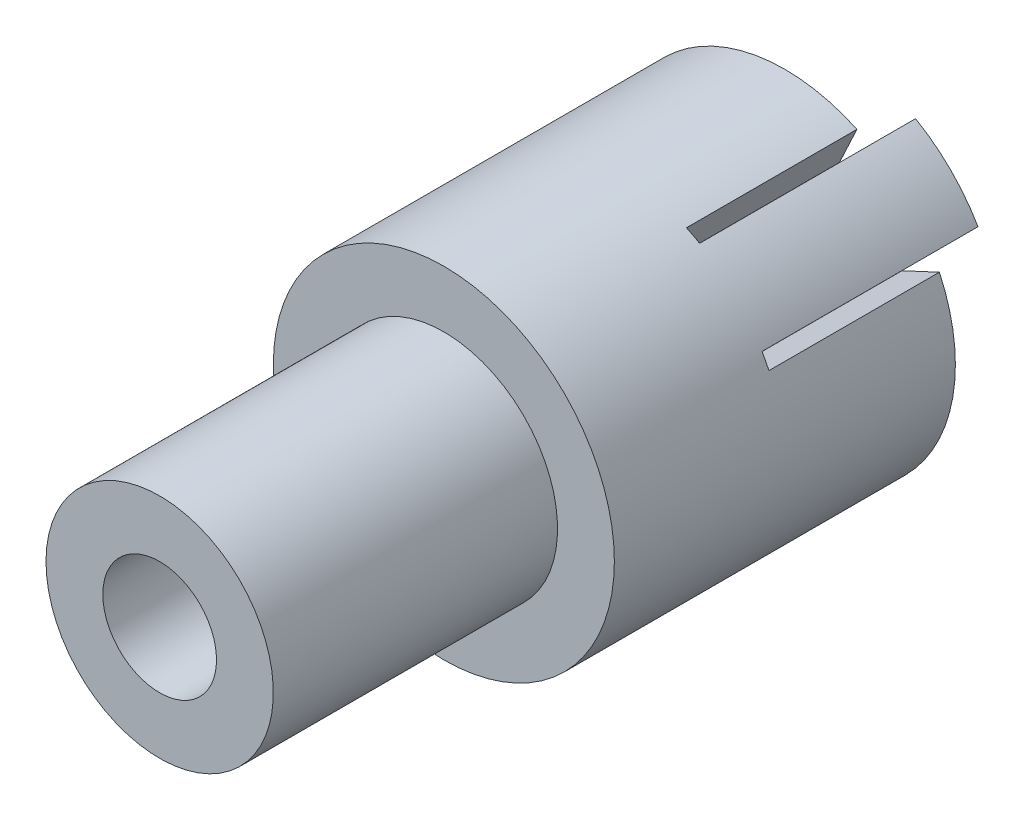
ISO-10303-21;
HEADER;
FILE_DESCRIPTION(('STEP AP214'),'2;1');
FILE_NAME('part.step','',(''),(''),'','','');
FILE_SCHEMA(('AUTOMOTIVE_DESIGN { 1 0 10303 214 1 1 1 1 }'));
ENDSEC;
DATA;
#1=APPLICATION_CONTEXT('core data for automotive mechanical design processes');
#2=APPLICATION_PROTOCOL_DEFINITION('international standard','automotive_design',2000,#1);
#3=PRODUCT_CONTEXT('',#1,'mechanical');
#4=PRODUCT('Part','Part','',(#3));
#5=PRODUCT_RELATED_PRODUCT_CATEGORY('part','',(#4));
#6=PRODUCT_DEFINITION_FORMATION('','',#4);
#7=PRODUCT_DEFINITION_CONTEXT('part definition',#1,'design');
#8=PRODUCT_DEFINITION('design','',#6,#7);
#9=PRODUCT_DEFINITION_SHAPE('','',#8);
#10=(LENGTH_UNIT() NAMED_UNIT(*) SI_UNIT(.MILLI.,.METRE.));
#11=(NAMED_UNIT(*) PLANE_ANGLE_UNIT() SI_UNIT($,.RADIAN.));
#12=(NAMED_UNIT(*) SI_UNIT($,.STERADIAN.) SOLID_ANGLE_UNIT());
#13=UNCERTAINTY_MEASURE_WITH_UNIT(LENGTH_MEASURE(1.E-05),#10,'distance_accuracy_value','');
#14=(GEOMETRIC_REPRESENTATION_CONTEXT(3) GLOBAL_UNCERTAINTY_ASSIGNED_CONTEXT((#13)) GLOBAL_UNIT_ASSIGNED_CONTEXT((#10,
#11,#12)) REPRESENTATION_CONTEXT('',''));
#15=CARTESIAN_POINT('',(0.,0.,0.));
#16=DIRECTION('',(0.,0.,1.));
#17=DIRECTION('',(1.,0.,0.));
#18=AXIS2_PLACEMENT_3D('',#15,#16,#17);
#19=CARTESIAN_POINT('',(0.,-6.45994289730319,-21.6921134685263));
#20=DIRECTION('',(0.,0.,1.));
#21=DIRECTION('',(1.,0.,0.));
#22=AXIS2_PLACEMENT_3D('',#19,#20,#21);
#23=PLANE('',#22);
#24=DIRECTION('',(0.500000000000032,0.86602540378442,0.));
#25=VECTOR('',#24,1.);
#26=CARTESIAN_POINT('',(2.88775199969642,-1.45820971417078,-21.6921134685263));
#27=LINE('',#26,#25);
#28=CARTESIAN_POINT('',(2.88775199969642,-1.45820971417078,-21.6921134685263));
#29=VERTEX_POINT('',#28);
#30=CARTESIAN_POINT('',(2.89215908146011,-1.45057642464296,-21.6921134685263));
#31=VERTEX_POINT('',#30);
#32=EDGE_CURVE('E308',#29,#31,#27,.T.);
#33=ORIENTED_EDGE('',*,*,#32,.T.);
#34=CARTESIAN_POINT('',(-0.0575872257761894,-6.49319089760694,-21.6921134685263));
#35=DIRECTION('',(0.,0.,-1.));
#36=DIRECTION('',(-1.,0.,0.));
#37=AXIS2_PLACEMENT_3D('',#34,#35,#36);
#38=CIRCLE('',#37,5.842);
#39=CARTESIAN_POINT('',(5.00173318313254,-3.57219089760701,-21.6921134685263));
#40=VERTEX_POINT('',#39);
#41=EDGE_CURVE('E240',#31,#40,#38,.T.);
#42=ORIENTED_EDGE('',*,*,#41,.T.);
#43=CARTESIAN_POINT('',(0.,-6.45994289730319,-21.6921134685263));
#44=DIRECTION('',(0.,0.,1.));
#45=DIRECTION('',(1.,0.,0.));
#46=AXIS2_PLACEMENT_3D('',#43,#44,#45);
#47=CIRCLE('',#46,5.77550399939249);
#48=EDGE_CURVE('E244',#40,#29,#47,.T.);
#49=ORIENTED_EDGE('',*,*,#48,.T.);
#50=EDGE_LOOP('',(#33,#42,#49));
#51=FACE_BOUND('',#50,.T.);
#52=ADVANCED_FACE('F33',(#51),#23,.F.);
#53=CARTESIAN_POINT('',(0.,-2.71643889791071,-19.6601134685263));
#54=DIRECTION('',(0.,0.,-1.));
#55=DIRECTION('',(-1.,0.,0.));
#56=AXIS2_PLACEMENT_3D('',#53,#54,#55);
#57=PLANE('',#56);
#58=DIRECTION('',(-0.906307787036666,-0.422618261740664,0.));
#59=VECTOR('',#58,1.);
#60=CARTESIAN_POINT('',(5.23438424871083,-4.01910943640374,-19.6601134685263));
#61=LINE('',#60,#59);
#62=CARTESIAN_POINT('',(6.90606533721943,-3.23959174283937,-19.6601134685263));
#63=VERTEX_POINT('',#62);
#64=CARTESIAN_POINT('',(5.23438424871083,-4.01910943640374,-19.6601134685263));
#65=VERTEX_POINT('',#64);
#66=EDGE_CURVE('E324',#63,#65,#61,.T.);
#67=ORIENTED_EDGE('',*,*,#66,.F.);
#68=CARTESIAN_POINT('',(0.,-6.45994289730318,-19.6601134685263));
#69=DIRECTION('',(0.,0.,-1.));
#70=DIRECTION('',(-1.,0.,0.));
#71=AXIS2_PLACEMENT_3D('',#68,#69,#70);
#72=CIRCLE('',#71,7.62);
#73=CARTESIAN_POINT('',(3.22035115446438,0.446122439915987,-19.6601134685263));
#74=VERTEX_POINT('',#73);
#75=EDGE_CURVE('E474',#63,#74,#72,.T.);
#76=ORIENTED_EDGE('',*,*,#75,.T.);
#77=DIRECTION('',(0.422618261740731,0.906307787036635,0.));
#78=VECTOR('',#77,1.);
#79=CARTESIAN_POINT('',(2.4408334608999,-1.22555864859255,-19.6601134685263));
#80=LINE('',#79,#78);
#81=CARTESIAN_POINT('',(2.4408334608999,-1.22555864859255,-19.6601134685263));
#82=VERTEX_POINT('',#81);
#83=EDGE_CURVE('E320',#82,#74,#80,.T.);
#84=ORIENTED_EDGE('',*,*,#83,.F.);
#85=CARTESIAN_POINT('',(0.,-6.45994289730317,-19.6601134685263));
#86=DIRECTION('',(0.,0.,-1.));
#87=DIRECTION('',(1.,0.,0.));
#88=AXIS2_PLACEMENT_3D('',#85,#86,#87);
#89=CIRCLE('',#88,5.77550399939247);
#90=CARTESIAN_POINT('',(0.,-0.684438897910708,-19.6601134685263));
#91=VERTEX_POINT('',#90);
#92=EDGE_CURVE('E407',#91,#82,#89,.T.);
#93=ORIENTED_EDGE('',*,*,#92,.F.);
#94=DIRECTION('',(0.,1.,0.));
#95=VECTOR('',#94,1.);
#96=CARTESIAN_POINT('',(0.,-2.71643889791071,-19.6601134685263));
#97=LINE('',#96,#95);
#98=CARTESIAN_POINT('',(0.,-2.71643889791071,-19.6601134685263));
#99=VERTEX_POINT('',#98);
#100=EDGE_CURVE('E384',#99,#91,#97,.T.);
#101=ORIENTED_EDGE('',*,*,#100,.F.);
#102=CARTESIAN_POINT('',(0.,-6.45994289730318,-19.6601134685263));
#103=DIRECTION('',(0.,0.,-1.));
#104=DIRECTION('',(-1.,0.,0.));
#105=AXIS2_PLACEMENT_3D('',#102,#103,#104);
#106=CIRCLE('',#105,3.74350399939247);
#107=CARTESIAN_POINT('',(-3.74350399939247,-6.45994289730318,-19.6601134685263));
#108=VERTEX_POINT('',#107);
#109=EDGE_CURVE('E478',#108,#99,#106,.T.);
#110=ORIENTED_EDGE('',*,*,#109,.F.);
#111=DIRECTION('',(1.,0.,0.));
#112=VECTOR('',#111,1.);
#113=CARTESIAN_POINT('',(-3.74350399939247,-6.45994289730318,-19.6601134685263));
#114=LINE('',#113,#112);
#115=CARTESIAN_POINT('',(-5.77550399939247,-6.45994289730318,-19.6601134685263));
#116=VERTEX_POINT('',#115);
#117=EDGE_CURVE('E365',#116,#108,#114,.T.);
#118=ORIENTED_EDGE('',*,*,#117,.F.);
#119=CARTESIAN_POINT('',(0.,-6.45994289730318,-19.6601134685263));
#120=DIRECTION('',(0.,0.,-1.));
#121=DIRECTION('',(1.,0.,0.));
#122=AXIS2_PLACEMENT_3D('',#119,#120,#121);
#123=CIRCLE('',#122,5.77550399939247);
#124=CARTESIAN_POINT('',(0.,-12.2354468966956,-19.6601134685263));
#125=VERTEX_POINT('',#124);
#126=EDGE_CURVE('E377',#125,#116,#123,.T.);
#127=ORIENTED_EDGE('',*,*,#126,.F.);
#128=DIRECTION('',(0.,-1.,0.));
#129=VECTOR('',#128,1.);
#130=CARTESIAN_POINT('',(0.,-10.2034468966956,-19.6601134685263));
#131=LINE('',#130,#129);
#132=CARTESIAN_POINT('',(0.,-10.2034468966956,-19.6601134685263));
#133=VERTEX_POINT('',#132);
#134=EDGE_CURVE('E336',#133,#125,#131,.T.);
#135=ORIENTED_EDGE('',*,*,#134,.F.);
#136=CARTESIAN_POINT('',(3.74350399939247,-6.45994289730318,-19.6601134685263));
#137=VERTEX_POINT('',#136);
#138=EDGE_CURVE('E477',#137,#133,#106,.T.);
#139=ORIENTED_EDGE('',*,*,#138,.F.);
#140=DIRECTION('',(-1.,0.,0.));
#141=VECTOR('',#140,1.);
#142=CARTESIAN_POINT('',(3.74350399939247,-6.45994289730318,-19.6601134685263));
#143=LINE('',#142,#141);
#144=CARTESIAN_POINT('',(5.77550399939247,-6.45994289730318,-19.6601134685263));
#145=VERTEX_POINT('',#144);
#146=EDGE_CURVE('E394',#145,#137,#143,.T.);
#147=ORIENTED_EDGE('',*,*,#146,.F.);
#148=EDGE_CURVE('E406',#65,#145,#89,.T.);
#149=ORIENTED_EDGE('',*,*,#148,.F.);
#150=EDGE_LOOP('',(#67,#76,#84,#93,#101,#110,#118,#127,#135,#139,#147,#149));
#151=FACE_BOUND('',#150,.T.);
#152=ADVANCED_FACE('F298',(#151),#57,.T.);
#153=CARTESIAN_POINT('',(0.,-6.45994289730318,-7.46811346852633));
#154=DIRECTION('',(0.,0.,-1.));
#155=DIRECTION('',(-1.,0.,0.));
#156=AXIS2_PLACEMENT_3D('',#153,#154,#155);
#157=CONICAL_SURFACE('',#156,3.74350399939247,0.797169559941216);
#158=DIRECTION('',(0.715381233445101,0.,0.69873434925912));
#159=VECTOR('',#158,1.);
#160=CARTESIAN_POINT('',(0.,-6.45994289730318,-3.81172061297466));
#161=LINE('',#160,#159);
#162=CARTESIAN_POINT('',(-5.77494089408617,-6.45994289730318,-9.452278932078));
#163=VERTEX_POINT('',#162);
#164=CARTESIAN_POINT('',(-3.74350399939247,-6.45994289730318,-7.46811346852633));
#165=VERTEX_POINT('',#164);
#166=EDGE_CURVE('E466',#163,#165,#161,.T.);
#167=ORIENTED_EDGE('',*,*,#166,.F.);
#168=CARTESIAN_POINT('',(0.,-6.45994289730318,-9.452278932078));
#169=DIRECTION('',(0.,0.,-1.));
#170=DIRECTION('',(-1.,0.,0.));
#171=AXIS2_PLACEMENT_3D('',#168,#169,#170);
#172=CIRCLE('',#171,5.77494089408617);
#173=CARTESIAN_POINT('',(0.,-0.685002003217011,-9.452278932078));
#174=VERTEX_POINT('',#173);
#175=EDGE_CURVE('E498',#163,#174,#172,.T.);
#176=ORIENTED_EDGE('',*,*,#175,.T.);
#177=DIRECTION('',(0.,0.715381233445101,-0.69873434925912));
#178=VECTOR('',#177,1.);
#179=CARTESIAN_POINT('',(0.,-6.45994289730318,-3.81172061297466));
#180=LINE('',#179,#178);
#181=CARTESIAN_POINT('',(0.,-2.71643889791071,-7.46811346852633));
#182=VERTEX_POINT('',#181);
#183=EDGE_CURVE('E430',#182,#174,#180,.T.);
#184=ORIENTED_EDGE('',*,*,#183,.F.);
#185=CARTESIAN_POINT('',(0.,-6.45994289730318,-7.46811346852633));
#186=DIRECTION('',(0.,0.,-1.));
#187=DIRECTION('',(-1.,0.,0.));
#188=AXIS2_PLACEMENT_3D('',#185,#186,#187);
#189=CIRCLE('',#188,3.74350399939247);
#190=EDGE_CURVE('E502',#165,#182,#189,.T.);
#191=ORIENTED_EDGE('',*,*,#190,.F.);
#192=EDGE_LOOP('',(#167,#176,#184,#191));
#193=FACE_BOUND('',#192,.T.);
#194=ADVANCED_FACE('F304',(#193),#157,.F.);
#195=CARTESIAN_POINT('',(0.,-6.45994289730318,-9.452278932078));
#196=DIRECTION('',(0.,0.,1.));
#197=DIRECTION('',(1.,0.,0.));
#198=AXIS2_PLACEMENT_3D('',#195,#196,#197);
#199=CONICAL_SURFACE('',#198,5.77494089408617,0.773626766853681);
#200=DIRECTION('',(-0.69873434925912,0.,0.715381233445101));
#201=VECTOR('',#200,1.);
#202=CARTESIAN_POINT('',(0.,-6.45994289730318,-15.3648039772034));
#203=LINE('',#202,#201);
#204=CARTESIAN_POINT('',(-3.74350399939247,-6.45994289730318,-11.5321134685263));
#205=VERTEX_POINT('',#204);
#206=EDGE_CURVE('E464',#205,#163,#203,.T.);
#207=ORIENTED_EDGE('',*,*,#206,.F.);
#208=CARTESIAN_POINT('',(0.,-6.45994289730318,-11.5321134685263));
#209=DIRECTION('',(0.,0.,-1.));
#210=DIRECTION('',(-1.,0.,0.));
#211=AXIS2_PLACEMENT_3D('',#208,#209,#210);
#212=CIRCLE('',#211,3.74350399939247);
#213=CARTESIAN_POINT('',(0.,-2.71643889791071,-11.5321134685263));
#214=VERTEX_POINT('',#213);
#215=EDGE_CURVE('E494',#205,#214,#212,.T.);
#216=ORIENTED_EDGE('',*,*,#215,.T.);
#217=DIRECTION('',(0.,-0.69873434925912,-0.715381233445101));
#218=VECTOR('',#217,1.);
#219=CARTESIAN_POINT('',(0.,-6.45994289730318,-15.3648039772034));
#220=LINE('',#219,#218);
#221=EDGE_CURVE('E428',#174,#214,#220,.T.);
#222=ORIENTED_EDGE('',*,*,#221,.F.);
#223=ORIENTED_EDGE('',*,*,#175,.F.);
#224=EDGE_LOOP('',(#207,#216,#222,#223));
#225=FACE_BOUND('',#224,.T.);
#226=ADVANCED_FACE('F545',(#225),#199,.F.);
#227=CARTESIAN_POINT('',(0.,-6.45994289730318,-11.5321134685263));
#228=DIRECTION('',(0.,0.,-1.));
#229=DIRECTION('',(-1.,0.,0.));
#230=AXIS2_PLACEMENT_3D('',#227,#228,#229);
#231=CONICAL_SURFACE('',#230,3.74350399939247,0.797169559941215);
#232=DIRECTION('',(0.7153812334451,0.,0.698734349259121));
#233=VECTOR('',#232,1.);
#234=CARTESIAN_POINT('',(0.,-6.45994289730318,-7.87572061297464));
#235=LINE('',#234,#233);
#236=CARTESIAN_POINT('',(-5.77494089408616,-6.45994289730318,-13.516278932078));
#237=VERTEX_POINT('',#236);
#238=EDGE_CURVE('E462',#237,#205,#235,.T.);
#239=ORIENTED_EDGE('',*,*,#238,.F.);
#240=CARTESIAN_POINT('',(0.,-6.45994289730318,-13.516278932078));
#241=DIRECTION('',(0.,0.,-1.));
#242=DIRECTION('',(-1.,0.,0.));
#243=AXIS2_PLACEMENT_3D('',#240,#241,#242);
#244=CIRCLE('',#243,5.77494089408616);
#245=CARTESIAN_POINT('',(0.,-0.685002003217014,-13.516278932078));
#246=VERTEX_POINT('',#245);
#247=EDGE_CURVE('E490',#237,#246,#244,.T.);
#248=ORIENTED_EDGE('',*,*,#247,.T.);
#249=DIRECTION('',(0.,0.7153812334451,-0.698734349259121));
#250=VECTOR('',#249,1.);
#251=CARTESIAN_POINT('',(0.,-6.45994289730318,-7.87572061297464));
#252=LINE('',#251,#250);
#253=EDGE_CURVE('E426',#214,#246,#252,.T.);
#254=ORIENTED_EDGE('',*,*,#253,.F.);
#255=ORIENTED_EDGE('',*,*,#215,.F.);
#256=EDGE_LOOP('',(#239,#248,#254,#255));
#257=FACE_BOUND('',#256,.T.);
#258=ADVANCED_FACE('F550',(#257),#231,.F.);
#259=CARTESIAN_POINT('',(0.,-6.45994289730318,-13.516278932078));
#260=DIRECTION('',(0.,0.,1.));
#261=DIRECTION('',(1.,0.,0.));
#262=AXIS2_PLACEMENT_3D('',#259,#260,#261);
#263=CONICAL_SURFACE('',#262,5.77494089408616,0.773626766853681);
#264=DIRECTION('',(-0.698734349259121,0.,0.7153812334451));
#265=VECTOR('',#264,1.);
#266=CARTESIAN_POINT('',(0.,-6.45994289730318,-19.4288039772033));
#267=LINE('',#266,#265);
#268=CARTESIAN_POINT('',(-3.74350399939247,-6.45994289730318,-15.5961134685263));
#269=VERTEX_POINT('',#268);
#270=EDGE_CURVE('E460',#269,#237,#267,.T.);
#271=ORIENTED_EDGE('',*,*,#270,.F.);
#272=CARTESIAN_POINT('',(0.,-6.45994289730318,-15.5961134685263));
#273=DIRECTION('',(0.,0.,-1.));
#274=DIRECTION('',(-1.,0.,0.));
#275=AXIS2_PLACEMENT_3D('',#272,#273,#274);
#276=CIRCLE('',#275,3.74350399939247);
#277=CARTESIAN_POINT('',(0.,-2.71643889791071,-15.5961134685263));
#278=VERTEX_POINT('',#277);
#279=EDGE_CURVE('E486',#269,#278,#276,.T.);
#280=ORIENTED_EDGE('',*,*,#279,.T.);
#281=DIRECTION('',(0.,-0.698734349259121,-0.7153812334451));
#282=VECTOR('',#281,1.);
#283=CARTESIAN_POINT('',(0.,-6.45994289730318,-19.4288039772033));
#284=LINE('',#283,#282);
#285=EDGE_CURVE('E424',#246,#278,#284,.T.);
#286=ORIENTED_EDGE('',*,*,#285,.F.);
#287=ORIENTED_EDGE('',*,*,#247,.F.);
#288=EDGE_LOOP('',(#271,#280,#286,#287));
#289=FACE_BOUND('',#288,.T.);
#290=ADVANCED_FACE('F555',(#289),#263,.F.);
#291=CARTESIAN_POINT('',(0.,-6.45994289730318,-15.5961134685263));
#292=DIRECTION('',(0.,0.,-1.));
#293=DIRECTION('',(-1.,0.,0.));
#294=AXIS2_PLACEMENT_3D('',#291,#292,#293);
#295=CONICAL_SURFACE('',#294,3.74350399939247,0.797169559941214);
#296=DIRECTION('',(0.7153812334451,0.,0.698734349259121));
#297=VECTOR('',#296,1.);
#298=CARTESIAN_POINT('',(0.,-6.45994289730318,-11.9397206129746));
#299=LINE('',#298,#297);
#300=CARTESIAN_POINT('',(-5.77494089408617,-6.45994289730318,-17.580278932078));
#301=VERTEX_POINT('',#300);
#302=EDGE_CURVE('E458',#301,#269,#299,.T.);
#303=ORIENTED_EDGE('',*,*,#302,.F.);
#304=CARTESIAN_POINT('',(0.,-6.45994289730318,-17.580278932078));
#305=DIRECTION('',(0.,0.,-1.));
#306=DIRECTION('',(-1.,0.,0.));
#307=AXIS2_PLACEMENT_3D('',#304,#305,#306);
#308=CIRCLE('',#307,5.77494089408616);
#309=CARTESIAN_POINT('',(0.,-0.685002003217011,-17.580278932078));
#310=VERTEX_POINT('',#309);
#311=EDGE_CURVE('E482',#301,#310,#308,.T.);
#312=ORIENTED_EDGE('',*,*,#311,.T.);
#313=DIRECTION('',(0.,0.7153812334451,-0.698734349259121));
#314=VECTOR('',#313,1.);
#315=CARTESIAN_POINT('',(0.,-6.45994289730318,-11.9397206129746));
#316=LINE('',#315,#314);
#317=EDGE_CURVE('E422',#278,#310,#316,.T.);
#318=ORIENTED_EDGE('',*,*,#317,.F.);
#319=ORIENTED_EDGE('',*,*,#279,.F.);
#320=EDGE_LOOP('',(#303,#312,#318,#319));
#321=FACE_BOUND('',#320,.T.);
#322=ADVANCED_FACE('F560',(#321),#295,.F.);
#323=CARTESIAN_POINT('',(0.,-6.45994289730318,-17.580278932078));
#324=DIRECTION('',(0.,0.,1.));
#325=DIRECTION('',(1.,0.,0.));
#326=AXIS2_PLACEMENT_3D('',#323,#324,#325);
#327=CONICAL_SURFACE('',#326,5.77494089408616,0.773626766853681);
#328=DIRECTION('',(-0.698734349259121,0.,0.7153812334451));
#329=VECTOR('',#328,1.);
#330=CARTESIAN_POINT('',(0.,-6.45994289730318,-23.4928039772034));
#331=LINE('',#330,#329);
#332=EDGE_CURVE('E456',#108,#301,#331,.T.);
#333=ORIENTED_EDGE('',*,*,#332,.F.);
#334=ORIENTED_EDGE('',*,*,#109,.T.);
#335=DIRECTION('',(0.,-0.698734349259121,-0.7153812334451));
#336=VECTOR('',#335,1.);
#337=CARTESIAN_POINT('',(0.,-6.45994289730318,-23.4928039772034));
#338=LINE('',#337,#336);
#339=EDGE_CURVE('E414',#310,#99,#338,.T.);
#340=ORIENTED_EDGE('',*,*,#339,.F.);
#341=ORIENTED_EDGE('',*,*,#311,.F.);
#342=EDGE_LOOP('',(#333,#334,#340,#341));
#343=FACE_BOUND('',#342,.T.);
#344=ADVANCED_FACE('F564',(#343),#327,.F.);
#345=CARTESIAN_POINT('',(0.,-6.45994289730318,-23.4383387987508));
#346=DIRECTION('',(0.,0.,-1.));
#347=DIRECTION('',(-1.,0.,0.));
#348=AXIS2_PLACEMENT_3D('',#345,#346,#347);
#349=CYLINDRICAL_SURFACE('',#348,5.08);
#350=CARTESIAN_POINT('',(0.,-6.45994289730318,8.27988653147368));
#351=DIRECTION('',(0.,0.,-1.));
#352=DIRECTION('',(-1.,0.,0.));
#353=AXIS2_PLACEMENT_3D('',#350,#351,#352);
#354=CIRCLE('',#353,5.08);
#355=CARTESIAN_POINT('',(-5.08,-6.45994289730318,8.27988653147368));
#356=VERTEX_POINT('',#355);
#357=EDGE_CURVE('E11',#356,#356,#354,.T.);
#358=ORIENTED_EDGE('',*,*,#357,.T.);
#359=EDGE_LOOP('',(#358));
#360=FACE_BOUND('',#359,.T.);
#361=CARTESIAN_POINT('',(0.,-6.45994289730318,-4.42011346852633));
#362=DIRECTION('',(0.,0.,-1.));
#363=DIRECTION('',(-1.,0.,0.));
#364=AXIS2_PLACEMENT_3D('',#361,#362,#363);
#365=CIRCLE('',#364,5.08);
#366=CARTESIAN_POINT('',(-5.08,-6.45994289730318,-4.42011346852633));
#367=VERTEX_POINT('',#366);
#368=EDGE_CURVE('E468',#367,#367,#365,.T.);
#369=ORIENTED_EDGE('',*,*,#368,.F.);
#370=EDGE_LOOP('',(#369));
#371=FACE_BOUND('',#370,.T.);
#372=ADVANCED_FACE('F35',(#360,#371),#349,.T.);
#373=CARTESIAN_POINT('',(0.,-1.37994289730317,8.27988653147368));
#374=DIRECTION('',(0.,0.,1.));
#375=DIRECTION('',(1.,0.,0.));
#376=AXIS2_PLACEMENT_3D('',#373,#374,#375);
#377=PLANE('',#376);
#378=CARTESIAN_POINT('',(0.,-6.45994289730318,8.27988653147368));
#379=DIRECTION('',(0.,0.,-1.));
#380=DIRECTION('',(-1.,0.,0.));
#381=AXIS2_PLACEMENT_3D('',#378,#379,#380);
#382=CIRCLE('',#381,2.54);
#383=CARTESIAN_POINT('',(-2.54,-6.45994289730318,8.27988653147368));
#384=VERTEX_POINT('',#383);
#385=EDGE_CURVE('E41',#384,#384,#382,.T.);
#386=ORIENTED_EDGE('',*,*,#385,.T.);
#387=EDGE_LOOP('',(#386));
#388=FACE_BOUND('',#387,.T.);
#389=ORIENTED_EDGE('',*,*,#357,.F.);
#390=EDGE_LOOP('',(#389));
#391=FACE_BOUND('',#390,.T.);
#392=ADVANCED_FACE('F513',(#388,#391),#377,.T.);
#393=CARTESIAN_POINT('',(0.,-6.45994289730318,-23.4383387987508));
#394=DIRECTION('',(0.,0.,-1.));
#395=DIRECTION('',(-1.,0.,0.));
#396=AXIS2_PLACEMENT_3D('',#393,#394,#395);
#397=CYLINDRICAL_SURFACE('',#396,2.54);
#398=CARTESIAN_POINT('',(0.,-6.45994289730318,-4.42011346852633));
#399=DIRECTION('',(0.,0.,-1.));
#400=DIRECTION('',(-1.,0.,0.));
#401=AXIS2_PLACEMENT_3D('',#398,#399,#400);
#402=CIRCLE('',#401,2.54);
#403=CARTESIAN_POINT('',(-2.54,-6.45994289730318,-4.42011346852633));
#404=VERTEX_POINT('',#403);
#405=EDGE_CURVE('E508',#404,#404,#402,.T.);
#406=ORIENTED_EDGE('',*,*,#405,.T.);
#407=EDGE_LOOP('',(#406));
#408=FACE_BOUND('',#407,.T.);
#409=ORIENTED_EDGE('',*,*,#385,.F.);
#410=EDGE_LOOP('',(#409));
#411=FACE_BOUND('',#410,.T.);
#412=ADVANCED_FACE('F516',(#408,#411),#397,.F.);
#413=CARTESIAN_POINT('',(0.,-3.91994289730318,-4.42011346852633));
#414=DIRECTION('',(0.,0.,1.));
#415=DIRECTION('',(1.,0.,0.));
#416=AXIS2_PLACEMENT_3D('',#413,#414,#415);
#417=PLANE('',#416);
#418=ORIENTED_EDGE('',*,*,#405,.F.);
#419=EDGE_LOOP('',(#418));
#420=FACE_BOUND('',#419,.T.);
#421=ADVANCED_FACE('F518',(#420),#417,.T.);
#422=CARTESIAN_POINT('',(0.,-2.71643889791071,-6.96011346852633));
#423=DIRECTION('',(0.,0.,-1.));
#424=DIRECTION('',(-1.,0.,0.));
#425=AXIS2_PLACEMENT_3D('',#422,#423,#424);
#426=PLANE('',#425);
#427=CARTESIAN_POINT('',(0.,-6.45994289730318,-6.96011346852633));
#428=DIRECTION('',(0.,0.,-1.));
#429=DIRECTION('',(-1.,0.,0.));
#430=AXIS2_PLACEMENT_3D('',#427,#428,#429);
#431=CIRCLE('',#430,3.74350399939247);
#432=CARTESIAN_POINT('',(-3.74350399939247,-6.45994289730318,-6.96011346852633));
#433=VERTEX_POINT('',#432);
#434=EDGE_CURVE('E505',#433,#433,#431,.T.);
#435=ORIENTED_EDGE('',*,*,#434,.T.);
#436=EDGE_LOOP('',(#435));
#437=FACE_BOUND('',#436,.T.);
#438=ADVANCED_FACE('F525',(#437),#426,.T.);
#439=CARTESIAN_POINT('',(0.,-6.45994289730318,-23.4383387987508));
#440=DIRECTION('',(0.,0.,-1.));
#441=DIRECTION('',(-1.,0.,0.));
#442=AXIS2_PLACEMENT_3D('',#439,#440,#441);
#443=CYLINDRICAL_SURFACE('',#442,3.74350399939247);
#444=DIRECTION('',(0.,0.,-1.));
#445=VECTOR('',#444,1.);
#446=CARTESIAN_POINT('',(-3.74350399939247,-6.45994289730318,-7.21411346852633));
#447=LINE('',#446,#445);
#448=CARTESIAN_POINT('',(-3.74350399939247,-6.45994289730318,-7.21411346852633));
#449=VERTEX_POINT('',#448);
#450=EDGE_CURVE('E381',#449,#165,#447,.T.);
#451=ORIENTED_EDGE('',*,*,#450,.T.);
#452=ORIENTED_EDGE('',*,*,#190,.T.);
#453=DIRECTION('',(0.,0.,-1.));
#454=VECTOR('',#453,1.);
#455=CARTESIAN_POINT('',(0.,-2.71643889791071,-7.21411346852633));
#456=LINE('',#455,#454);
#457=CARTESIAN_POINT('',(0.,-2.71643889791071,-7.21411346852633));
#458=VERTEX_POINT('',#457);
#459=EDGE_CURVE('E403',#458,#182,#456,.T.);
#460=ORIENTED_EDGE('',*,*,#459,.F.);
#461=CARTESIAN_POINT('',(0.,-6.45994289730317,-7.21411346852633));
#462=DIRECTION('',(0.,0.,1.));
#463=DIRECTION('',(1.,0.,0.));
#464=AXIS2_PLACEMENT_3D('',#461,#462,#463);
#465=CIRCLE('',#464,3.74350399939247);
#466=CARTESIAN_POINT('',(3.74350399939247,-6.45994289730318,-7.21411346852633));
#467=VERTEX_POINT('',#466);
#468=EDGE_CURVE('E390',#467,#458,#465,.T.);
#469=ORIENTED_EDGE('',*,*,#468,.F.);
#470=DIRECTION('',(0.,0.,-1.));
#471=VECTOR('',#470,1.);
#472=CARTESIAN_POINT('',(3.74350399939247,-6.45994289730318,-7.21411346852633));
#473=LINE('',#472,#471);
#474=CARTESIAN_POINT('',(3.74350399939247,-6.45994289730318,-7.46811346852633));
#475=VERTEX_POINT('',#474);
#476=EDGE_CURVE('E411',#467,#475,#473,.T.);
#477=ORIENTED_EDGE('',*,*,#476,.T.);
#478=CARTESIAN_POINT('',(0.,-10.2034468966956,-7.46811346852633));
#479=VERTEX_POINT('',#478);
#480=EDGE_CURVE('E501',#475,#479,#189,.T.);
#481=ORIENTED_EDGE('',*,*,#480,.T.);
#482=DIRECTION('',(0.,0.,-1.));
#483=VECTOR('',#482,1.);
#484=CARTESIAN_POINT('',(0.,-10.2034468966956,-7.21411346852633));
#485=LINE('',#484,#483);
#486=CARTESIAN_POINT('',(0.,-10.2034468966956,-7.21411346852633));
#487=VERTEX_POINT('',#486);
#488=EDGE_CURVE('E374',#487,#479,#485,.T.);
#489=ORIENTED_EDGE('',*,*,#488,.F.);
#490=CARTESIAN_POINT('',(0.,-6.45994289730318,-7.21411346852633));
#491=DIRECTION('',(0.,0.,1.));
#492=DIRECTION('',(1.,0.,0.));
#493=AXIS2_PLACEMENT_3D('',#490,#491,#492);
#494=CIRCLE('',#493,3.74350399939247);
#495=EDGE_CURVE('E361',#449,#487,#494,.T.);
#496=ORIENTED_EDGE('',*,*,#495,.F.);
#497=EDGE_LOOP('',(#451,#452,#460,#469,#477,#481,#489,#496));
#498=FACE_BOUND('',#497,.T.);
#499=ORIENTED_EDGE('',*,*,#434,.F.);
#500=EDGE_LOOP('',(#499));
#501=FACE_BOUND('',#500,.T.);
#502=ADVANCED_FACE('F531',(#498,#501),#443,.F.);
#503=DIRECTION('',(0.,-0.715381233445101,-0.69873434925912));
#504=VECTOR('',#503,1.);
#505=CARTESIAN_POINT('',(0.,-6.45994289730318,-3.81172061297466));
#506=LINE('',#505,#504);
#507=CARTESIAN_POINT('',(0.,-12.2348837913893,-9.452278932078));
#508=VERTEX_POINT('',#507);
#509=EDGE_CURVE('E454',#479,#508,#506,.T.);
#510=ORIENTED_EDGE('',*,*,#509,.F.);
#511=ORIENTED_EDGE('',*,*,#480,.F.);
#512=DIRECTION('',(-0.715381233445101,0.,0.69873434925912));
#513=VECTOR('',#512,1.);
#514=CARTESIAN_POINT('',(0.,-6.45994289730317,-3.81172061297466));
#515=LINE('',#514,#513);
#516=CARTESIAN_POINT('',(5.77494089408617,-6.45994289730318,-9.452278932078));
#517=VERTEX_POINT('',#516);
#518=EDGE_CURVE('E442',#517,#475,#515,.T.);
#519=ORIENTED_EDGE('',*,*,#518,.F.);
#520=EDGE_CURVE('E497',#517,#508,#172,.T.);
#521=ORIENTED_EDGE('',*,*,#520,.T.);
#522=EDGE_LOOP('',(#510,#511,#519,#521));
#523=FACE_BOUND('',#522,.T.);
#524=ADVANCED_FACE('F535',(#523),#157,.F.);
#525=DIRECTION('',(0.,0.69873434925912,-0.715381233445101));
#526=VECTOR('',#525,1.);
#527=CARTESIAN_POINT('',(0.,-6.45994289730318,-15.3648039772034));
#528=LINE('',#527,#526);
#529=CARTESIAN_POINT('',(0.,-10.2034468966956,-11.5321134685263));
#530=VERTEX_POINT('',#529);
#531=EDGE_CURVE('E452',#508,#530,#528,.T.);
#532=ORIENTED_EDGE('',*,*,#531,.F.);
#533=ORIENTED_EDGE('',*,*,#520,.F.);
#534=DIRECTION('',(0.69873434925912,0.,0.715381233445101));
#535=VECTOR('',#534,1.);
#536=CARTESIAN_POINT('',(0.,-6.45994289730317,-15.3648039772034));
#537=LINE('',#536,#535);
#538=CARTESIAN_POINT('',(3.74350399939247,-6.45994289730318,-11.5321134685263));
#539=VERTEX_POINT('',#538);
#540=EDGE_CURVE('E440',#539,#517,#537,.T.);
#541=ORIENTED_EDGE('',*,*,#540,.F.);
#542=EDGE_CURVE('E493',#539,#530,#212,.T.);
#543=ORIENTED_EDGE('',*,*,#542,.T.);
#544=EDGE_LOOP('',(#532,#533,#541,#543));
#545=FACE_BOUND('',#544,.T.);
#546=ADVANCED_FACE('F539',(#545),#199,.F.);
#547=DIRECTION('',(0.,-0.7153812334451,-0.698734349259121));
#548=VECTOR('',#547,1.);
#549=CARTESIAN_POINT('',(0.,-6.45994289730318,-7.87572061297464));
#550=LINE('',#549,#548);
#551=CARTESIAN_POINT('',(0.,-12.2348837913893,-13.516278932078));
#552=VERTEX_POINT('',#551);
#553=EDGE_CURVE('E450',#530,#552,#550,.T.);
#554=ORIENTED_EDGE('',*,*,#553,.F.);
#555=ORIENTED_EDGE('',*,*,#542,.F.);
#556=DIRECTION('',(-0.7153812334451,0.,0.698734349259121));
#557=VECTOR('',#556,1.);
#558=CARTESIAN_POINT('',(0.,-6.45994289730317,-7.87572061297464));
#559=LINE('',#558,#557);
#560=CARTESIAN_POINT('',(5.77494089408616,-6.45994289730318,-13.516278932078));
#561=VERTEX_POINT('',#560);
#562=EDGE_CURVE('E438',#561,#539,#559,.T.);
#563=ORIENTED_EDGE('',*,*,#562,.F.);
#564=EDGE_CURVE('E489',#561,#552,#244,.T.);
#565=ORIENTED_EDGE('',*,*,#564,.T.);
#566=EDGE_LOOP('',(#554,#555,#563,#565));
#567=FACE_BOUND('',#566,.T.);
#568=ADVANCED_FACE('F543',(#567),#231,.F.);
#569=DIRECTION('',(0.,0.698734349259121,-0.7153812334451));
#570=VECTOR('',#569,1.);
#571=CARTESIAN_POINT('',(0.,-6.45994289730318,-19.4288039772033));
#572=LINE('',#571,#570);
#573=CARTESIAN_POINT('',(0.,-10.2034468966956,-15.5961134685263));
#574=VERTEX_POINT('',#573);
#575=EDGE_CURVE('E448',#552,#574,#572,.T.);
#576=ORIENTED_EDGE('',*,*,#575,.F.);
#577=ORIENTED_EDGE('',*,*,#564,.F.);
#578=DIRECTION('',(0.698734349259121,0.,0.7153812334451));
#579=VECTOR('',#578,1.);
#580=CARTESIAN_POINT('',(0.,-6.45994289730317,-19.4288039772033));
#581=LINE('',#580,#579);
#582=CARTESIAN_POINT('',(3.74350399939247,-6.45994289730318,-15.5961134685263));
#583=VERTEX_POINT('',#582);
#584=EDGE_CURVE('E436',#583,#561,#581,.T.);
#585=ORIENTED_EDGE('',*,*,#584,.F.);
#586=EDGE_CURVE('E485',#583,#574,#276,.T.);
#587=ORIENTED_EDGE('',*,*,#586,.T.);
#588=EDGE_LOOP('',(#576,#577,#585,#587));
#589=FACE_BOUND('',#588,.T.);
#590=ADVANCED_FACE('F548',(#589),#263,.F.);
#591=DIRECTION('',(0.,-0.7153812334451,-0.698734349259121));
#592=VECTOR('',#591,1.);
#593=CARTESIAN_POINT('',(0.,-6.45994289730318,-11.9397206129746));
#594=LINE('',#593,#592);
#595=CARTESIAN_POINT('',(0.,-12.2348837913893,-17.580278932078));
#596=VERTEX_POINT('',#595);
#597=EDGE_CURVE('E446',#574,#596,#594,.T.);
#598=ORIENTED_EDGE('',*,*,#597,.F.);
#599=ORIENTED_EDGE('',*,*,#586,.F.);
#600=DIRECTION('',(-0.7153812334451,0.,0.698734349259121));
#601=VECTOR('',#600,1.);
#602=CARTESIAN_POINT('',(0.,-6.45994289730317,-11.9397206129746));
#603=LINE('',#602,#601);
#604=CARTESIAN_POINT('',(5.77494089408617,-6.45994289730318,-17.580278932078));
#605=VERTEX_POINT('',#604);
#606=EDGE_CURVE('E434',#605,#583,#603,.T.);
#607=ORIENTED_EDGE('',*,*,#606,.F.);
#608=EDGE_CURVE('E481',#605,#596,#308,.T.);
#609=ORIENTED_EDGE('',*,*,#608,.T.);
#610=EDGE_LOOP('',(#598,#599,#607,#609));
#611=FACE_BOUND('',#610,.T.);
#612=ADVANCED_FACE('F553',(#611),#295,.F.);
#613=DIRECTION('',(0.,0.698734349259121,-0.7153812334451));
#614=VECTOR('',#613,1.);
#615=CARTESIAN_POINT('',(0.,-6.45994289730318,-23.4928039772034));
#616=LINE('',#615,#614);
#617=EDGE_CURVE('E444',#596,#133,#616,.T.);
#618=ORIENTED_EDGE('',*,*,#617,.F.);
#619=ORIENTED_EDGE('',*,*,#608,.F.);
#620=DIRECTION('',(0.698734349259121,0.,0.7153812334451));
#621=VECTOR('',#620,1.);
#622=CARTESIAN_POINT('',(0.,-6.45994289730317,-23.4928039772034));
#623=LINE('',#622,#621);
#624=EDGE_CURVE('E432',#137,#605,#623,.T.);
#625=ORIENTED_EDGE('',*,*,#624,.F.);
#626=ORIENTED_EDGE('',*,*,#138,.T.);
#627=EDGE_LOOP('',(#618,#619,#625,#626));
#628=FACE_BOUND('',#627,.T.);
#629=ADVANCED_FACE('F558',(#628),#327,.F.);
#630=CARTESIAN_POINT('',(0.,-6.45994289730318,-23.4383387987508));
#631=DIRECTION('',(0.,0.,-1.));
#632=DIRECTION('',(-1.,0.,0.));
#633=AXIS2_PLACEMENT_3D('',#630,#631,#632);
#634=CYLINDRICAL_SURFACE('',#633,7.62);
#635=DIRECTION('',(0.,0.,-1.));
#636=VECTOR('',#635,1.);
#637=CARTESIAN_POINT('',(6.90606533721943,-3.23959174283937,-12.0401134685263));
#638=LINE('',#637,#636);
#639=CARTESIAN_POINT('',(6.90606533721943,-3.23959174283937,-12.0401134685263));
#640=VERTEX_POINT('',#639);
#641=EDGE_CURVE('E337',#640,#63,#638,.T.);
#642=ORIENTED_EDGE('',*,*,#641,.F.);
#643=CARTESIAN_POINT('',(0.,-6.45994289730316,-12.0401134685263));
#644=DIRECTION('',(0.,0.,-1.));
#645=DIRECTION('',(-1.,0.,0.));
#646=AXIS2_PLACEMENT_3D('',#643,#644,#645);
#647=CIRCLE('',#646,7.61999999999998);
#648=CARTESIAN_POINT('',(6.59911357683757,-2.64994289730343,-12.0401134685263));
#649=VERTEX_POINT('',#648);
#650=EDGE_CURVE('E327',#649,#640,#647,.T.);
#651=ORIENTED_EDGE('',*,*,#650,.F.);
#652=DIRECTION('',(0.,0.,-1.));
#653=VECTOR('',#652,1.);
#654=CARTESIAN_POINT('',(6.59911357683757,-2.64994289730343,-12.0401134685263));
#655=LINE('',#654,#653);
#656=CARTESIAN_POINT('',(6.59911357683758,-2.64994289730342,-21.6921134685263));
#657=VERTEX_POINT('',#656);
#658=EDGE_CURVE('E339',#649,#657,#655,.T.);
#659=ORIENTED_EDGE('',*,*,#658,.T.);
#660=CARTESIAN_POINT('',(0.,-6.4599428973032,-21.6921134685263));
#661=DIRECTION('',(0.,0.,-1.));
#662=DIRECTION('',(-1.,0.,0.));
#663=AXIS2_PLACEMENT_3D('',#660,#661,#662);
#664=CIRCLE('',#663,7.62000000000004);
#665=CARTESIAN_POINT('',(3.81000000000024,0.139170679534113,-21.6921134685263));
#666=VERTEX_POINT('',#665);
#667=EDGE_CURVE('E311',#666,#657,#664,.T.);
#668=ORIENTED_EDGE('',*,*,#667,.F.);
#669=DIRECTION('',(0.,0.,-1.));
#670=VECTOR('',#669,1.);
#671=CARTESIAN_POINT('',(3.81000000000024,0.139170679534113,-12.0401134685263));
#672=LINE('',#671,#670);
#673=CARTESIAN_POINT('',(3.81000000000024,0.139170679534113,-12.0401134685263));
#674=VERTEX_POINT('',#673);
#675=EDGE_CURVE('E355',#674,#666,#672,.T.);
#676=ORIENTED_EDGE('',*,*,#675,.F.);
#677=CARTESIAN_POINT('',(0.,-6.45994289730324,-12.0401134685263));
#678=DIRECTION('',(0.,0.,-1.));
#679=DIRECTION('',(-1.,0.,0.));
#680=AXIS2_PLACEMENT_3D('',#677,#678,#679);
#681=CIRCLE('',#680,7.62000000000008);
#682=CARTESIAN_POINT('',(3.22035115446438,0.446122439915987,-12.0401134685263));
#683=VERTEX_POINT('',#682);
#684=EDGE_CURVE('E348',#683,#674,#681,.T.);
#685=ORIENTED_EDGE('',*,*,#684,.F.);
#686=DIRECTION('',(0.,0.,-1.));
#687=VECTOR('',#686,1.);
#688=CARTESIAN_POINT('',(3.22035115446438,0.446122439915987,-12.0401134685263));
#689=LINE('',#688,#687);
#690=EDGE_CURVE('E357',#683,#74,#689,.T.);
#691=ORIENTED_EDGE('',*,*,#690,.T.);
#692=ORIENTED_EDGE('',*,*,#75,.F.);
#693=EDGE_LOOP('',(#642,#651,#659,#668,#676,#685,#691,#692));
#694=FACE_BOUND('',#693,.T.);
#695=CARTESIAN_POINT('',(0.,-6.45994289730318,-4.42011346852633));
#696=DIRECTION('',(0.,0.,-1.));
#697=DIRECTION('',(-1.,0.,0.));
#698=AXIS2_PLACEMENT_3D('',#695,#696,#697);
#699=CIRCLE('',#698,7.62);
#700=CARTESIAN_POINT('',(-7.62,-6.45994289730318,-4.42011346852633));
#701=VERTEX_POINT('',#700);
#702=EDGE_CURVE('E471',#701,#701,#699,.T.);
#703=ORIENTED_EDGE('',*,*,#702,.T.);
#704=EDGE_LOOP('',(#703));
#705=FACE_BOUND('',#704,.T.);
#706=ADVANCED_FACE('F562',(#694,#705),#634,.T.);
#707=CARTESIAN_POINT('',(0.,-1.37994289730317,-4.42011346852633));
#708=DIRECTION('',(0.,0.,1.));
#709=DIRECTION('',(1.,0.,0.));
#710=AXIS2_PLACEMENT_3D('',#707,#708,#709);
#711=PLANE('',#710);
#712=ORIENTED_EDGE('',*,*,#368,.T.);
#713=EDGE_LOOP('',(#712));
#714=FACE_BOUND('',#713,.T.);
#715=ORIENTED_EDGE('',*,*,#702,.F.);
#716=EDGE_LOOP('',(#715));
#717=FACE_BOUND('',#716,.T.);
#718=ADVANCED_FACE('F567',(#714,#717),#711,.T.);
#719=CARTESIAN_POINT('',(3.74350399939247,-6.45994289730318,-7.21411346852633));
#720=DIRECTION('',(0.,-1.,0.));
#721=DIRECTION('',(1.,0.,0.));
#722=AXIS2_PLACEMENT_3D('',#719,#720,#721);
#723=PLANE('',#722);
#724=ORIENTED_EDGE('',*,*,#518,.T.);
#725=ORIENTED_EDGE('',*,*,#476,.F.);
#726=DIRECTION('',(-1.,0.,0.));
#727=VECTOR('',#726,1.);
#728=CARTESIAN_POINT('',(3.74350399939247,-6.45994289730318,-7.21411346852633));
#729=LINE('',#728,#727);
#730=CARTESIAN_POINT('',(5.77550399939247,-6.45994289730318,-7.21411346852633));
#731=VERTEX_POINT('',#730);
#732=EDGE_CURVE('E400',#731,#467,#729,.T.);
#733=ORIENTED_EDGE('',*,*,#732,.F.);
#734=DIRECTION('',(0.,0.,-1.));
#735=VECTOR('',#734,1.);
#736=CARTESIAN_POINT('',(5.77550399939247,-6.45994289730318,-7.21411346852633));
#737=LINE('',#736,#735);
#738=EDGE_CURVE('E415',#731,#145,#737,.T.);
#739=ORIENTED_EDGE('',*,*,#738,.T.);
#740=ORIENTED_EDGE('',*,*,#146,.T.);
#741=ORIENTED_EDGE('',*,*,#624,.T.);
#742=ORIENTED_EDGE('',*,*,#606,.T.);
#743=ORIENTED_EDGE('',*,*,#584,.T.);
#744=ORIENTED_EDGE('',*,*,#562,.T.);
#745=ORIENTED_EDGE('',*,*,#540,.T.);
#746=EDGE_LOOP('',(#724,#725,#733,#739,#740,#741,#742,#743,#744,#745));
#747=FACE_BOUND('',#746,.T.);
#748=ADVANCED_FACE('F571',(#747),#723,.F.);
#749=CARTESIAN_POINT('',(0.,-6.45994289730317,-7.21411346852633));
#750=DIRECTION('',(0.,0.,-1.));
#751=DIRECTION('',(-1.,0.,0.));
#752=AXIS2_PLACEMENT_3D('',#749,#750,#751);
#753=CYLINDRICAL_SURFACE('',#752,5.77550399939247);
#754=CARTESIAN_POINT('',(-3.21791204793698E-13,-6.45994289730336,-12.0401134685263));
#755=DIRECTION('',(0.,0.,1.));
#756=DIRECTION('',(-1.,0.,0.));
#757=AXIS2_PLACEMENT_3D('',#754,#755,#756);
#758=CIRCLE('',#757,5.77550399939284);
#759=CARTESIAN_POINT('',(5.23438424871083,-4.01910943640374,-12.0401134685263));
#760=VERTEX_POINT('',#759);
#761=CARTESIAN_POINT('',(5.00173318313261,-3.57219089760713,-12.0401134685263));
#762=VERTEX_POINT('',#761);
#763=EDGE_CURVE('E321',#760,#762,#758,.T.);
#764=ORIENTED_EDGE('',*,*,#763,.F.);
#765=DIRECTION('',(0.,0.,-1.));
#766=VECTOR('',#765,1.);
#767=CARTESIAN_POINT('',(5.23438424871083,-4.01910943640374,-12.0401134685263));
#768=LINE('',#767,#766);
#769=EDGE_CURVE('E333',#760,#65,#768,.T.);
#770=ORIENTED_EDGE('',*,*,#769,.T.);
#771=ORIENTED_EDGE('',*,*,#148,.T.);
#772=ORIENTED_EDGE('',*,*,#738,.F.);
#773=CARTESIAN_POINT('',(0.,-6.45994289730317,-7.21411346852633));
#774=DIRECTION('',(0.,0.,-1.));
#775=DIRECTION('',(1.,0.,0.));
#776=AXIS2_PLACEMENT_3D('',#773,#774,#775);
#777=CIRCLE('',#776,5.77550399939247);
#778=CARTESIAN_POINT('',(0.,-0.684438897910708,-7.21411346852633));
#779=VERTEX_POINT('',#778);
#780=EDGE_CURVE('E397',#779,#731,#777,.T.);
#781=ORIENTED_EDGE('',*,*,#780,.F.);
#782=DIRECTION('',(0.,0.,-1.));
#783=VECTOR('',#782,1.);
#784=CARTESIAN_POINT('',(0.,-0.684438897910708,-7.21411346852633));
#785=LINE('',#784,#783);
#786=EDGE_CURVE('E418',#779,#91,#785,.T.);
#787=ORIENTED_EDGE('',*,*,#786,.T.);
#788=ORIENTED_EDGE('',*,*,#92,.T.);
#789=DIRECTION('',(0.,0.,-1.));
#790=VECTOR('',#789,1.);
#791=CARTESIAN_POINT('',(2.4408334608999,-1.22555864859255,-12.0401134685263));
#792=LINE('',#791,#790);
#793=CARTESIAN_POINT('',(2.4408334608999,-1.22555864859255,-12.0401134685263));
#794=VERTEX_POINT('',#793);
#795=EDGE_CURVE('E352',#794,#82,#792,.T.);
#796=ORIENTED_EDGE('',*,*,#795,.F.);
#797=CARTESIAN_POINT('',(0.,-6.45994289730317,-12.0401134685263));
#798=DIRECTION('',(0.,0.,1.));
#799=DIRECTION('',(-1.,0.,0.));
#800=AXIS2_PLACEMENT_3D('',#797,#798,#799);
#801=CIRCLE('',#800,5.77550399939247);
#802=CARTESIAN_POINT('',(2.88775199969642,-1.45820971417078,-12.0401134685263));
#803=VERTEX_POINT('',#802);
#804=EDGE_CURVE('E343',#803,#794,#801,.T.);
#805=ORIENTED_EDGE('',*,*,#804,.F.);
#806=DIRECTION('',(0.,0.,-1.));
#807=VECTOR('',#806,1.);
#808=CARTESIAN_POINT('',(2.88775199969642,-1.45820971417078,-12.0401134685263));
#809=LINE('',#808,#807);
#810=EDGE_CURVE('E332',#803,#29,#809,.T.);
#811=ORIENTED_EDGE('',*,*,#810,.T.);
#812=ORIENTED_EDGE('',*,*,#48,.F.);
#813=DIRECTION('',(0.,0.,-1.));
#814=VECTOR('',#813,1.);
#815=CARTESIAN_POINT('',(5.00173318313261,-3.57219089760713,-21.6921134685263));
#816=LINE('',#815,#814);
#817=CARTESIAN_POINT('',(5.00173318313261,-3.57219089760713,-20.5985762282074));
#818=VERTEX_POINT('',#817);
#819=EDGE_CURVE('E245',#40,#818,#816,.F.);
#820=ORIENTED_EDGE('',*,*,#819,.T.);
#821=DIRECTION('',(0.,0.,-1.));
#822=VECTOR('',#821,1.);
#823=CARTESIAN_POINT('',(5.00173318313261,-3.57219089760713,-12.0401134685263));
#824=LINE('',#823,#822);
#825=EDGE_CURVE('E330',#762,#818,#824,.T.);
#826=ORIENTED_EDGE('',*,*,#825,.F.);
#827=EDGE_LOOP('',(#764,#770,#771,#772,#781,#787,#788,#796,#805,#811,#812,#820,#826));
#828=FACE_BOUND('',#827,.T.);
#829=ADVANCED_FACE('F577',(#828),#753,.F.);
#830=CARTESIAN_POINT('',(0.,-2.71643889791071,-7.21411346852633));
#831=DIRECTION('',(-1.,0.,0.));
#832=DIRECTION('',(0.,0.,1.));
#833=AXIS2_PLACEMENT_3D('',#830,#831,#832);
#834=PLANE('',#833);
#835=ORIENTED_EDGE('',*,*,#183,.T.);
#836=ORIENTED_EDGE('',*,*,#221,.T.);
#837=ORIENTED_EDGE('',*,*,#253,.T.);
#838=ORIENTED_EDGE('',*,*,#285,.T.);
#839=ORIENTED_EDGE('',*,*,#317,.T.);
#840=ORIENTED_EDGE('',*,*,#339,.T.);
#841=ORIENTED_EDGE('',*,*,#100,.T.);
#842=ORIENTED_EDGE('',*,*,#786,.F.);
#843=DIRECTION('',(0.,1.,0.));
#844=VECTOR('',#843,1.);
#845=CARTESIAN_POINT('',(0.,-2.71643889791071,-7.21411346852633));
#846=LINE('',#845,#844);
#847=EDGE_CURVE('E393',#458,#779,#846,.T.);
#848=ORIENTED_EDGE('',*,*,#847,.F.);
#849=ORIENTED_EDGE('',*,*,#459,.T.);
#850=EDGE_LOOP('',(#835,#836,#837,#838,#839,#840,#841,#842,#848,#849));
#851=FACE_BOUND('',#850,.T.);
#852=ADVANCED_FACE('F573',(#851),#834,.F.);
#853=CARTESIAN_POINT('',(0.,-6.45994289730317,-7.21411346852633));
#854=DIRECTION('',(0.,0.,1.));
#855=DIRECTION('',(1.,0.,0.));
#856=AXIS2_PLACEMENT_3D('',#853,#854,#855);
#857=PLANE('',#856);
#858=ORIENTED_EDGE('',*,*,#468,.T.);
#859=ORIENTED_EDGE('',*,*,#847,.T.);
#860=ORIENTED_EDGE('',*,*,#780,.T.);
#861=ORIENTED_EDGE('',*,*,#732,.T.);
#862=EDGE_LOOP('',(#858,#859,#860,#861));
#863=FACE_BOUND('',#862,.T.);
#864=ADVANCED_FACE('F576',(#863),#857,.F.);
#865=CARTESIAN_POINT('',(-3.74350399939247,-6.45994289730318,-7.21411346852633));
#866=DIRECTION('',(0.,1.,0.));
#867=DIRECTION('',(0.,0.,1.));
#868=AXIS2_PLACEMENT_3D('',#865,#866,#867);
#869=PLANE('',#868);
#870=ORIENTED_EDGE('',*,*,#166,.T.);
#871=ORIENTED_EDGE('',*,*,#450,.F.);
#872=DIRECTION('',(1.,0.,0.));
#873=VECTOR('',#872,1.);
#874=CARTESIAN_POINT('',(-3.74350399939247,-6.45994289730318,-7.21411346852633));
#875=LINE('',#874,#873);
#876=CARTESIAN_POINT('',(-5.77550399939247,-6.45994289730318,-7.21411346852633));
#877=VERTEX_POINT('',#876);
#878=EDGE_CURVE('E371',#877,#449,#875,.T.);
#879=ORIENTED_EDGE('',*,*,#878,.F.);
#880=DIRECTION('',(0.,0.,-1.));
#881=VECTOR('',#880,1.);
#882=CARTESIAN_POINT('',(-5.77550399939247,-6.45994289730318,-7.21411346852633));
#883=LINE('',#882,#881);
#884=EDGE_CURVE('E385',#877,#116,#883,.T.);
#885=ORIENTED_EDGE('',*,*,#884,.T.);
#886=ORIENTED_EDGE('',*,*,#117,.T.);
#887=ORIENTED_EDGE('',*,*,#332,.T.);
#888=ORIENTED_EDGE('',*,*,#302,.T.);
#889=ORIENTED_EDGE('',*,*,#270,.T.);
#890=ORIENTED_EDGE('',*,*,#238,.T.);
#891=ORIENTED_EDGE('',*,*,#206,.T.);
#892=EDGE_LOOP('',(#870,#871,#879,#885,#886,#887,#888,#889,#890,#891));
#893=FACE_BOUND('',#892,.T.);
#894=ADVANCED_FACE('F587',(#893),#869,.F.);
#895=CARTESIAN_POINT('',(0.,-6.45994289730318,-7.21411346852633));
#896=DIRECTION('',(0.,0.,-1.));
#897=DIRECTION('',(-1.,0.,0.));
#898=AXIS2_PLACEMENT_3D('',#895,#896,#897);
#899=CYLINDRICAL_SURFACE('',#898,5.77550399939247);
#900=ORIENTED_EDGE('',*,*,#126,.T.);
#901=ORIENTED_EDGE('',*,*,#884,.F.);
#902=CARTESIAN_POINT('',(0.,-6.45994289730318,-7.21411346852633));
#903=DIRECTION('',(0.,0.,-1.));
#904=DIRECTION('',(1.,0.,0.));
#905=AXIS2_PLACEMENT_3D('',#902,#903,#904);
#906=CIRCLE('',#905,5.77550399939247);
#907=CARTESIAN_POINT('',(0.,-12.2354468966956,-7.21411346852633));
#908=VERTEX_POINT('',#907);
#909=EDGE_CURVE('E368',#908,#877,#906,.T.);
#910=ORIENTED_EDGE('',*,*,#909,.F.);
#911=DIRECTION('',(0.,0.,-1.));
#912=VECTOR('',#911,1.);
#913=CARTESIAN_POINT('',(0.,-12.2354468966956,-7.21411346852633));
#914=LINE('',#913,#912);
#915=EDGE_CURVE('E387',#908,#125,#914,.T.);
#916=ORIENTED_EDGE('',*,*,#915,.T.);
#917=EDGE_LOOP('',(#900,#901,#910,#916));
#918=FACE_BOUND('',#917,.T.);
#919=ADVANCED_FACE('F593',(#918),#899,.F.);
#920=CARTESIAN_POINT('',(0.,-10.2034468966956,-7.21411346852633));
#921=DIRECTION('',(1.,0.,0.));
#922=DIRECTION('',(0.,1.,0.));
#923=AXIS2_PLACEMENT_3D('',#920,#921,#922);
#924=PLANE('',#923);
#925=ORIENTED_EDGE('',*,*,#509,.T.);
#926=ORIENTED_EDGE('',*,*,#531,.T.);
#927=ORIENTED_EDGE('',*,*,#553,.T.);
#928=ORIENTED_EDGE('',*,*,#575,.T.);
#929=ORIENTED_EDGE('',*,*,#597,.T.);
#930=ORIENTED_EDGE('',*,*,#617,.T.);
#931=ORIENTED_EDGE('',*,*,#134,.T.);
#932=ORIENTED_EDGE('',*,*,#915,.F.);
#933=DIRECTION('',(0.,-1.,0.));
#934=VECTOR('',#933,1.);
#935=CARTESIAN_POINT('',(0.,-10.2034468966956,-7.21411346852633));
#936=LINE('',#935,#934);
#937=EDGE_CURVE('E364',#487,#908,#936,.T.);
#938=ORIENTED_EDGE('',*,*,#937,.F.);
#939=ORIENTED_EDGE('',*,*,#488,.T.);
#940=EDGE_LOOP('',(#925,#926,#927,#928,#929,#930,#931,#932,#938,#939));
#941=FACE_BOUND('',#940,.T.);
#942=ADVANCED_FACE('F589',(#941),#924,.F.);
#943=CARTESIAN_POINT('',(0.,-6.45994289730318,-7.21411346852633));
#944=DIRECTION('',(0.,0.,1.));
#945=DIRECTION('',(1.,0.,0.));
#946=AXIS2_PLACEMENT_3D('',#943,#944,#945);
#947=PLANE('',#946);
#948=ORIENTED_EDGE('',*,*,#495,.T.);
#949=ORIENTED_EDGE('',*,*,#937,.T.);
#950=ORIENTED_EDGE('',*,*,#909,.T.);
#951=ORIENTED_EDGE('',*,*,#878,.T.);
#952=EDGE_LOOP('',(#948,#949,#950,#951));
#953=FACE_BOUND('',#952,.T.);
#954=ADVANCED_FACE('F592',(#953),#947,.F.);
#955=CARTESIAN_POINT('',(2.88775199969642,-1.45820971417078,-12.0401134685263));
#956=DIRECTION('',(0.86602540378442,-0.500000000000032,0.));
#957=DIRECTION('',(0.500000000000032,0.86602540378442,0.));
#958=AXIS2_PLACEMENT_3D('',#955,#956,#957);
#959=PLANE('',#958);
#960=CARTESIAN_POINT('',(3.146209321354,-1.01054850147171,-21.6923134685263));
#961=CARTESIAN_POINT('',(3.10385991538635,-1.08389982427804,-21.5099905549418));
#962=CARTESIAN_POINT('',(3.0615104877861,-1.15725118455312,-21.3276676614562));
#963=CARTESIAN_POINT('',(2.97681158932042,-1.30395398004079,-20.9630219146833));
#964=CARTESIAN_POINT('',(2.93446211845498,-1.37730541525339,-20.7806990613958));
#965=CARTESIAN_POINT('',(2.89211262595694,-1.45065688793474,-20.5983762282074));
#966=B_SPLINE_CURVE_WITH_KNOTS('',3,(#960,#961,#962,#963,#964,#965),.UNSPECIFIED.,.F.,.F.,(4,2,
4),(0.,0.60310844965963,1.20621689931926),.UNSPECIFIED.);
#967=CARTESIAN_POINT('',(3.14616286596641,-1.0106289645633,-21.6921134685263));
#968=VERTEX_POINT('',#967);
#969=CARTESIAN_POINT('',(2.89215908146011,-1.45057642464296,-20.5985762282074));
#970=VERTEX_POINT('',#969);
#971=EDGE_CURVE('E48',#968,#970,#966,.T.);
#972=ORIENTED_EDGE('',*,*,#971,.T.);
#973=DIRECTION('',(0.,0.,-1.));
#974=VECTOR('',#973,1.);
#975=CARTESIAN_POINT('',(2.89215908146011,-1.45057642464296,-21.6921134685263));
#976=LINE('',#975,#974);
#977=EDGE_CURVE('E235',#970,#31,#976,.T.);
#978=ORIENTED_EDGE('',*,*,#977,.T.);
#979=ORIENTED_EDGE('',*,*,#32,.F.);
#980=ORIENTED_EDGE('',*,*,#810,.F.);
#981=DIRECTION('',(-0.500000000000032,-0.86602540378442,0.));
#982=VECTOR('',#981,1.);
#983=CARTESIAN_POINT('',(2.88775199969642,-1.45820971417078,-12.0401134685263));
#984=LINE('',#983,#982);
#985=EDGE_CURVE('E350',#674,#803,#984,.T.);
#986=ORIENTED_EDGE('',*,*,#985,.F.);
#987=ORIENTED_EDGE('',*,*,#675,.T.);
#988=EDGE_CURVE('E255',#968,#666,#27,.T.);
#989=ORIENTED_EDGE('',*,*,#988,.F.);
#990=EDGE_LOOP('',(#972,#978,#979,#980,#986,#987,#989));
#991=FACE_BOUND('',#990,.T.);
#992=ADVANCED_FACE('F253',(#991),#959,.F.);
#993=CARTESIAN_POINT('',(2.4408334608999,-1.22555864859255,-12.0401134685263));
#994=DIRECTION('',(-0.906307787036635,0.422618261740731,0.));
#995=DIRECTION('',(-0.422618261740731,-0.906307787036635,0.));
#996=AXIS2_PLACEMENT_3D('',#993,#994,#995);
#997=PLANE('',#996);
#998=ORIENTED_EDGE('',*,*,#83,.T.);
#999=ORIENTED_EDGE('',*,*,#690,.F.);
#1000=DIRECTION('',(0.422618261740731,0.906307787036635,0.));
#1001=VECTOR('',#1000,1.);
#1002=CARTESIAN_POINT('',(2.4408334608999,-1.22555864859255,-12.0401134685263));
#1003=LINE('',#1002,#1001);
#1004=EDGE_CURVE('E345',#794,#683,#1003,.T.);
#1005=ORIENTED_EDGE('',*,*,#1004,.F.);
#1006=ORIENTED_EDGE('',*,*,#795,.T.);
#1007=EDGE_LOOP('',(#998,#999,#1005,#1006));
#1008=FACE_BOUND('',#1007,.T.);
#1009=ADVANCED_FACE('F290',(#1008),#997,.F.);
#1010=CARTESIAN_POINT('',(0.,-6.45994289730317,-12.0401134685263));
#1011=DIRECTION('',(0.,0.,-1.));
#1012=DIRECTION('',(-1.,0.,0.));
#1013=AXIS2_PLACEMENT_3D('',#1010,#1011,#1012);
#1014=PLANE('',#1013);
#1015=ORIENTED_EDGE('',*,*,#804,.T.);
#1016=ORIENTED_EDGE('',*,*,#1004,.T.);
#1017=ORIENTED_EDGE('',*,*,#684,.T.);
#1018=ORIENTED_EDGE('',*,*,#985,.T.);
#1019=EDGE_LOOP('',(#1015,#1016,#1017,#1018));
#1020=FACE_BOUND('',#1019,.T.);
#1021=ADVANCED_FACE('F285',(#1020),#1014,.T.);
#1022=CARTESIAN_POINT('',(5.23438424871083,-4.01910943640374,-12.0401134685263));
#1023=DIRECTION('',(0.422618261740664,-0.906307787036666,0.));
#1024=DIRECTION('',(0.906307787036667,0.422618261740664,0.));
#1025=AXIS2_PLACEMENT_3D('',#1022,#1023,#1024);
#1026=PLANE('',#1025);
#1027=ORIENTED_EDGE('',*,*,#66,.T.);
#1028=ORIENTED_EDGE('',*,*,#769,.F.);
#1029=DIRECTION('',(-0.906307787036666,-0.422618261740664,0.));
#1030=VECTOR('',#1029,1.);
#1031=CARTESIAN_POINT('',(5.23438424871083,-4.01910943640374,-12.0401134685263));
#1032=LINE('',#1031,#1030);
#1033=EDGE_CURVE('E56',#640,#760,#1032,.T.);
#1034=ORIENTED_EDGE('',*,*,#1033,.F.);
#1035=ORIENTED_EDGE('',*,*,#641,.T.);
#1036=EDGE_LOOP('',(#1027,#1028,#1034,#1035));
#1037=FACE_BOUND('',#1036,.T.);
#1038=ADVANCED_FACE('F282',(#1037),#1026,.F.);
#1039=CARTESIAN_POINT('',(5.00173318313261,-3.57219089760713,-12.0401134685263));
#1040=DIRECTION('',(-0.499999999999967,0.866025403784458,0.));
#1041=DIRECTION('',(-0.866025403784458,-0.499999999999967,0.));
#1042=AXIS2_PLACEMENT_3D('',#1039,#1040,#1041);
#1043=PLANE('',#1042);
#1044=ORIENTED_EDGE('',*,*,#825,.T.);
#1045=DIRECTION('',(0.36486223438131,0.210653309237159,-0.906918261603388));
#1046=VECTOR('',#1045,1.);
#1047=CARTESIAN_POINT('',(-0.0575872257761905,-6.49319089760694,-8.02289796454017));
#1048=LINE('',#1047,#1046);
#1049=CARTESIAN_POINT('',(5.44167408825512,-3.31819089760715,-21.6921134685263));
#1050=VERTEX_POINT('',#1049);
#1051=EDGE_CURVE('E249',#818,#1050,#1048,.T.);
#1052=ORIENTED_EDGE('',*,*,#1051,.T.);
#1053=DIRECTION('',(-0.866025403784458,-0.499999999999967,0.));
#1054=VECTOR('',#1053,1.);
#1055=CARTESIAN_POINT('',(5.00173318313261,-3.57219089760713,-21.6921134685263));
#1056=LINE('',#1055,#1054);
#1057=EDGE_CURVE('E314',#657,#1050,#1056,.T.);
#1058=ORIENTED_EDGE('',*,*,#1057,.F.);
#1059=ORIENTED_EDGE('',*,*,#658,.F.);
#1060=DIRECTION('',(0.866025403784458,0.499999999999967,0.));
#1061=VECTOR('',#1060,1.);
#1062=CARTESIAN_POINT('',(5.00173318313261,-3.57219089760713,-12.0401134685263));
#1063=LINE('',#1062,#1061);
#1064=EDGE_CURVE('E323',#762,#649,#1063,.T.);
#1065=ORIENTED_EDGE('',*,*,#1064,.F.);
#1066=EDGE_LOOP('',(#1044,#1052,#1058,#1059,#1065));
#1067=FACE_BOUND('',#1066,.T.);
#1068=ADVANCED_FACE('F281',(#1067),#1043,.F.);
#1069=CARTESIAN_POINT('',(-3.21791204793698E-13,-6.45994289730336,-12.0401134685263));
#1070=DIRECTION('',(0.,0.,-1.));
#1071=DIRECTION('',(-1.,0.,0.));
#1072=AXIS2_PLACEMENT_3D('',#1069,#1070,#1071);
#1073=PLANE('',#1072);
#1074=ORIENTED_EDGE('',*,*,#763,.T.);
#1075=ORIENTED_EDGE('',*,*,#1064,.T.);
#1076=ORIENTED_EDGE('',*,*,#650,.T.);
#1077=ORIENTED_EDGE('',*,*,#1033,.T.);
#1078=EDGE_LOOP('',(#1074,#1075,#1076,#1077));
#1079=FACE_BOUND('',#1078,.T.);
#1080=ADVANCED_FACE('F277',(#1079),#1073,.T.);
#1081=ORIENTED_EDGE('',*,*,#1057,.T.);
#1082=CARTESIAN_POINT('',(-0.0575872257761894,-6.49319089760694,-21.6921134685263));
#1083=DIRECTION('',(0.,0.,-1.));
#1084=DIRECTION('',(-1.,0.,0.));
#1085=AXIS2_PLACEMENT_3D('',#1082,#1083,#1084);
#1086=CIRCLE('',#1085,6.35);
#1087=EDGE_CURVE('E250',#968,#1050,#1086,.T.);
#1088=ORIENTED_EDGE('',*,*,#1087,.F.);
#1089=ORIENTED_EDGE('',*,*,#988,.T.);
#1090=ORIENTED_EDGE('',*,*,#667,.T.);
#1091=EDGE_LOOP('',(#1081,#1088,#1089,#1090));
#1092=FACE_BOUND('',#1091,.T.);
#1093=ADVANCED_FACE('F274',(#1092),#23,.F.);
#1094=CARTESIAN_POINT('',(-0.0575872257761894,-6.49319089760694,-21.6921134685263));
#1095=DIRECTION('',(0.,0.,-1.));
#1096=DIRECTION('',(-1.,0.,0.));
#1097=AXIS2_PLACEMENT_3D('',#1094,#1095,#1096);
#1098=CYLINDRICAL_SURFACE('',#1097,5.842);
#1099=CARTESIAN_POINT('',(-0.0575872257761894,-6.49319089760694,-20.5985762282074));
#1100=DIRECTION('',(0.,0.,-1.));
#1101=DIRECTION('',(-1.,0.,0.));
#1102=AXIS2_PLACEMENT_3D('',#1099,#1100,#1101);
#1103=CIRCLE('',#1102,5.842);
#1104=EDGE_CURVE('E237',#970,#818,#1103,.T.);
#1105=ORIENTED_EDGE('',*,*,#1104,.T.);
#1106=ORIENTED_EDGE('',*,*,#819,.F.);
#1107=ORIENTED_EDGE('',*,*,#41,.F.);
#1108=ORIENTED_EDGE('',*,*,#977,.F.);
#1109=EDGE_LOOP('',(#1105,#1106,#1107,#1108));
#1110=FACE_BOUND('',#1109,.T.);
#1111=ADVANCED_FACE('F236',(#1110),#1098,.T.);
#1112=CARTESIAN_POINT('',(-0.0575872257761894,-6.49319089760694,-21.6921134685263));
#1113=DIRECTION('',(0.,0.,-1.));
#1114=DIRECTION('',(-1.,0.,0.));
#1115=AXIS2_PLACEMENT_3D('',#1112,#1113,#1114);
#1116=CONICAL_SURFACE('',#1115,6.35,0.434885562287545);
#1117=ORIENTED_EDGE('',*,*,#1087,.T.);
#1118=ORIENTED_EDGE('',*,*,#1051,.F.);
#1119=ORIENTED_EDGE('',*,*,#1104,.F.);
#1120=ORIENTED_EDGE('',*,*,#971,.F.);
#1121=EDGE_LOOP('',(#1117,#1118,#1119,#1120));
#1122=FACE_BOUND('',#1121,.T.);
#1123=ADVANCED_FACE('F247',(#1122),#1116,.F.);
#1124=CLOSED_SHELL('',(#52,#152,#194,#226,#258,#290,#322,#344,#372,#392,#412,#421,#438,#502,
#524,#546,#568,#590,#612,#629,#706,#718,#748,#829,#852,#864,#894,#919,#942,#954,#992,#1009,
#1021,#1038,#1068,#1080,#1093,#1111,#1123));
#1125=MANIFOLD_SOLID_BREP('B2',#1124);
#1126=ADVANCED_BREP_SHAPE_REPRESENTATION('',(#18,#1125),#14);
#1127=SHAPE_DEFINITION_REPRESENTATION(#9,#1126);
ENDSEC;
END-ISO-10303-21;
